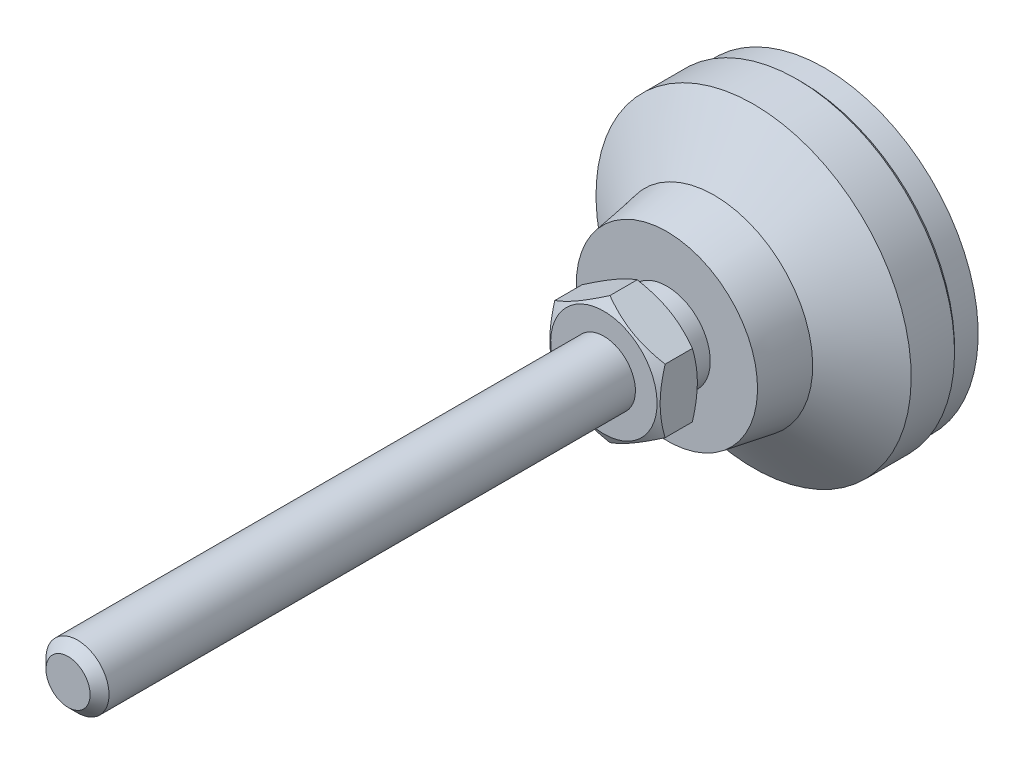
ISO-10303-21;
HEADER;
FILE_DESCRIPTION(('STEP AP214'),'2;1');
FILE_NAME('part.step','',(''),(''),'','','');
FILE_SCHEMA(('AUTOMOTIVE_DESIGN { 1 0 10303 214 1 1 1 1 }'));
ENDSEC;
DATA;
#1=APPLICATION_CONTEXT('core data for automotive mechanical design processes');
#2=APPLICATION_PROTOCOL_DEFINITION('international standard','automotive_design',2000,#1);
#3=PRODUCT_CONTEXT('',#1,'mechanical');
#4=PRODUCT('Part','Part','',(#3));
#5=PRODUCT_RELATED_PRODUCT_CATEGORY('part','',(#4));
#6=PRODUCT_DEFINITION_FORMATION('','',#4);
#7=PRODUCT_DEFINITION_CONTEXT('part definition',#1,'design');
#8=PRODUCT_DEFINITION('design','',#6,#7);
#9=PRODUCT_DEFINITION_SHAPE('','',#8);
#10=(LENGTH_UNIT() NAMED_UNIT(*) SI_UNIT(.MILLI.,.METRE.));
#11=(NAMED_UNIT(*) PLANE_ANGLE_UNIT() SI_UNIT($,.RADIAN.));
#12=(NAMED_UNIT(*) SI_UNIT($,.STERADIAN.) SOLID_ANGLE_UNIT());
#13=UNCERTAINTY_MEASURE_WITH_UNIT(LENGTH_MEASURE(1.E-05),#10,'distance_accuracy_value','');
#14=(GEOMETRIC_REPRESENTATION_CONTEXT(3) GLOBAL_UNCERTAINTY_ASSIGNED_CONTEXT((#13)) GLOBAL_UNIT_ASSIGNED_CONTEXT((#10,
#11,#12)) REPRESENTATION_CONTEXT('',''));
#15=CARTESIAN_POINT('',(0.,0.,0.));
#16=DIRECTION('',(0.,0.,1.));
#17=DIRECTION('',(1.,0.,0.));
#18=AXIS2_PLACEMENT_3D('',#15,#16,#17);
#19=CARTESIAN_POINT('',(0.,0.,1.99999999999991));
#20=DIRECTION('',(0.,0.,-1.));
#21=DIRECTION('',(0.,1.,0.));
#22=AXIS2_PLACEMENT_3D('',#19,#20,#21);
#23=CYLINDRICAL_SURFACE('',#22,20.);
#24=CARTESIAN_POINT('',(0.,0.,3.5));
#25=DIRECTION('',(0.,0.,-1.));
#26=DIRECTION('',(0.,1.,0.));
#27=AXIS2_PLACEMENT_3D('',#24,#25,#26);
#28=CIRCLE('',#27,20.);
#29=CARTESIAN_POINT('',(0.,20.,3.5));
#30=VERTEX_POINT('',#29);
#31=EDGE_CURVE('E28',#30,#30,#28,.F.);
#32=ORIENTED_EDGE('',*,*,#31,.T.);
#33=EDGE_LOOP('',(#32));
#34=FACE_BOUND('',#33,.T.);
#35=CARTESIAN_POINT('',(0.,0.,9.));
#36=DIRECTION('',(0.,0.,-1.));
#37=DIRECTION('',(0.,1.,0.));
#38=AXIS2_PLACEMENT_3D('',#35,#36,#37);
#39=CIRCLE('',#38,20.);
#40=CARTESIAN_POINT('',(0.,20.,9.));
#41=VERTEX_POINT('',#40);
#42=EDGE_CURVE('E112',#41,#41,#39,.T.);
#43=ORIENTED_EDGE('',*,*,#42,.T.);
#44=EDGE_LOOP('',(#43));
#45=FACE_BOUND('',#44,.T.);
#46=ADVANCED_FACE('F14',(#34,#45),#23,.T.);
#47=CARTESIAN_POINT('',(0.,0.,14.));
#48=DIRECTION('',(0.,0.,-1.));
#49=DIRECTION('',(0.,1.,0.));
#50=AXIS2_PLACEMENT_3D('',#47,#48,#49);
#51=CONICAL_SURFACE('',#50,12.5,0.98279372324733);
#52=ORIENTED_EDGE('',*,*,#42,.F.);
#53=EDGE_LOOP('',(#52));
#54=FACE_BOUND('',#53,.T.);
#55=CARTESIAN_POINT('',(0.,0.,14.));
#56=DIRECTION('',(0.,0.,-1.));
#57=DIRECTION('',(0.,1.,0.));
#58=AXIS2_PLACEMENT_3D('',#55,#56,#57);
#59=CIRCLE('',#58,12.5);
#60=CARTESIAN_POINT('',(0.,12.5,14.));
#61=VERTEX_POINT('',#60);
#62=EDGE_CURVE('E109',#61,#61,#59,.T.);
#63=ORIENTED_EDGE('',*,*,#62,.T.);
#64=EDGE_LOOP('',(#63));
#65=FACE_BOUND('',#64,.T.);
#66=ADVANCED_FACE('F142',(#54,#65),#51,.T.);
#67=CARTESIAN_POINT('',(0.,0.,20.));
#68=DIRECTION('',(0.,0.,-1.));
#69=DIRECTION('',(0.,1.,0.));
#70=AXIS2_PLACEMENT_3D('',#67,#68,#69);
#71=CONICAL_SURFACE('',#70,11.5,0.165148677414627);
#72=ORIENTED_EDGE('',*,*,#62,.F.);
#73=EDGE_LOOP('',(#72));
#74=FACE_BOUND('',#73,.T.);
#75=CARTESIAN_POINT('',(0.,0.,20.));
#76=DIRECTION('',(0.,0.,-1.));
#77=DIRECTION('',(0.,1.,0.));
#78=AXIS2_PLACEMENT_3D('',#75,#76,#77);
#79=CIRCLE('',#78,11.5);
#80=CARTESIAN_POINT('',(0.,11.5,20.));
#81=VERTEX_POINT('',#80);
#82=EDGE_CURVE('E106',#81,#81,#79,.T.);
#83=ORIENTED_EDGE('',*,*,#82,.T.);
#84=EDGE_LOOP('',(#83));
#85=FACE_BOUND('',#84,.T.);
#86=ADVANCED_FACE('F147',(#74,#85),#71,.T.);
#87=CARTESIAN_POINT('',(-11.5,0.,20.));
#88=DIRECTION('',(0.,0.,-1.));
#89=DIRECTION('',(0.,1.,0.));
#90=AXIS2_PLACEMENT_3D('',#87,#88,#89);
#91=PLANE('',#90);
#92=ORIENTED_EDGE('',*,*,#82,.F.);
#93=EDGE_LOOP('',(#92));
#94=FACE_BOUND('',#93,.T.);
#95=CARTESIAN_POINT('',(0.,0.,20.));
#96=DIRECTION('',(0.,0.,-1.));
#97=DIRECTION('',(0.,1.,0.));
#98=AXIS2_PLACEMENT_3D('',#95,#96,#97);
#99=CIRCLE('',#98,5.49999999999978);
#100=CARTESIAN_POINT('',(0.,5.49999999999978,20.));
#101=VERTEX_POINT('',#100);
#102=EDGE_CURVE('E103',#101,#101,#99,.T.);
#103=ORIENTED_EDGE('',*,*,#102,.T.);
#104=EDGE_LOOP('',(#103));
#105=FACE_BOUND('',#104,.T.);
#106=ADVANCED_FACE('F153',(#94,#105),#91,.F.);
#107=CARTESIAN_POINT('',(0.,0.,1.99999999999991));
#108=DIRECTION('',(0.,0.,-1.));
#109=DIRECTION('',(0.,1.,0.));
#110=AXIS2_PLACEMENT_3D('',#107,#108,#109);
#111=CYLINDRICAL_SURFACE('',#110,5.49999999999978);
#112=ORIENTED_EDGE('',*,*,#102,.F.);
#113=EDGE_LOOP('',(#112));
#114=FACE_BOUND('',#113,.T.);
#115=CARTESIAN_POINT('',(0.,0.,23.));
#116=DIRECTION('',(0.,0.,-1.));
#117=DIRECTION('',(0.,1.,0.));
#118=AXIS2_PLACEMENT_3D('',#115,#116,#117);
#119=CIRCLE('',#118,5.49999999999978);
#120=CARTESIAN_POINT('',(0.,5.49999999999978,23.));
#121=VERTEX_POINT('',#120);
#122=EDGE_CURVE('E100',#121,#121,#119,.T.);
#123=ORIENTED_EDGE('',*,*,#122,.T.);
#124=EDGE_LOOP('',(#123));
#125=FACE_BOUND('',#124,.T.);
#126=ADVANCED_FACE('F157',(#114,#125),#111,.T.);
#127=CARTESIAN_POINT('',(-5.49999999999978,0.,23.));
#128=DIRECTION('',(0.,0.,1.));
#129=DIRECTION('',(0.,-1.,0.));
#130=AXIS2_PLACEMENT_3D('',#127,#128,#129);
#131=PLANE('',#130);
#132=CARTESIAN_POINT('',(0.,0.,23.));
#133=DIRECTION('',(0.,0.,1.));
#134=DIRECTION('',(0.,-1.,0.));
#135=AXIS2_PLACEMENT_3D('',#132,#133,#134);
#136=CIRCLE('',#135,6.75);
#137=CARTESIAN_POINT('',(0.,-6.75,23.));
#138=VERTEX_POINT('',#137);
#139=EDGE_CURVE('E287',#138,#138,#136,.T.);
#140=ORIENTED_EDGE('',*,*,#139,.F.);
#141=EDGE_LOOP('',(#140));
#142=FACE_BOUND('',#141,.T.);
#143=ORIENTED_EDGE('',*,*,#122,.F.);
#144=EDGE_LOOP('',(#143));
#145=FACE_BOUND('',#144,.T.);
#146=ADVANCED_FACE('F125',(#142,#145),#131,.F.);
#147=CARTESIAN_POINT('',(0.,0.,3.));
#148=DIRECTION('',(0.,0.,1.));
#149=DIRECTION('',(0.,-1.,0.));
#150=AXIS2_PLACEMENT_3D('',#147,#148,#149);
#151=CONICAL_SURFACE('',#150,19.5,0.785398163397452);
#152=ORIENTED_EDGE('',*,*,#31,.F.);
#153=EDGE_LOOP('',(#152));
#154=FACE_BOUND('',#153,.T.);
#155=CARTESIAN_POINT('',(0.,0.,3.));
#156=DIRECTION('',(0.,0.,-1.));
#157=DIRECTION('',(0.,1.,0.));
#158=AXIS2_PLACEMENT_3D('',#155,#156,#157);
#159=CIRCLE('',#158,19.5);
#160=CARTESIAN_POINT('',(0.,19.5,3.));
#161=VERTEX_POINT('',#160);
#162=EDGE_CURVE('E115',#161,#161,#159,.T.);
#163=ORIENTED_EDGE('',*,*,#162,.F.);
#164=EDGE_LOOP('',(#163));
#165=FACE_BOUND('',#164,.T.);
#166=ADVANCED_FACE('F16',(#154,#165),#151,.T.);
#167=CARTESIAN_POINT('',(0.,0.,0.));
#168=DIRECTION('',(0.,0.,1.));
#169=DIRECTION('',(0.,-1.,0.));
#170=AXIS2_PLACEMENT_3D('',#167,#168,#169);
#171=CYLINDRICAL_SURFACE('',#170,19.5);
#172=CARTESIAN_POINT('',(0.,0.,0.));
#173=DIRECTION('',(0.,0.,-1.));
#174=DIRECTION('',(0.,1.,0.));
#175=AXIS2_PLACEMENT_3D('',#172,#173,#174);
#176=CIRCLE('',#175,19.5);
#177=CARTESIAN_POINT('',(0.,19.5,0.));
#178=VERTEX_POINT('',#177);
#179=EDGE_CURVE('E262',#178,#178,#176,.T.);
#180=ORIENTED_EDGE('',*,*,#179,.F.);
#181=EDGE_LOOP('',(#180));
#182=FACE_BOUND('',#181,.T.);
#183=ORIENTED_EDGE('',*,*,#162,.T.);
#184=EDGE_LOOP('',(#183));
#185=FACE_BOUND('',#184,.T.);
#186=ADVANCED_FACE('F124',(#182,#185),#171,.T.);
#187=CARTESIAN_POINT('',(0.,0.,0.));
#188=DIRECTION('',(0.,0.,-1.));
#189=DIRECTION('',(0.,1.,0.));
#190=AXIS2_PLACEMENT_3D('',#187,#188,#189);
#191=PLANE('',#190);
#192=ORIENTED_EDGE('',*,*,#179,.T.);
#193=EDGE_LOOP('',(#192));
#194=FACE_BOUND('',#193,.T.);
#195=ADVANCED_FACE('F129',(#194),#191,.T.);
#196=CARTESIAN_POINT('',(0.,0.,23.));
#197=DIRECTION('',(0.,0.,1.));
#198=DIRECTION('',(0.,-1.,0.));
#199=AXIS2_PLACEMENT_3D('',#196,#197,#198);
#200=CONICAL_SURFACE('',#199,6.75,1.0471975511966);
#201=CARTESIAN_POINT('',(0.000200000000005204,-8.08301923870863,23.7696190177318));
#202=CARTESIAN_POINT('',(-0.153667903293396,-7.99418356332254,23.7183374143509));
#203=CARTESIAN_POINT('',(-0.308109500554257,-7.90501666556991,23.669383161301));
#204=CARTESIAN_POINT('',(-0.618246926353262,-7.72595873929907,23.5767703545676));
#205=CARTESIAN_POINT('',(-0.773943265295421,-7.63606741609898,23.5331140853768));
#206=CARTESIAN_POINT('',(-1.24352516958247,-7.36495417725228,23.4109491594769));
#207=CARTESIAN_POINT('',(-1.55926433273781,-7.18266208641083,23.3414631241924));
#208=CARTESIAN_POINT('',(-2.03176224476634,-6.90986528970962,23.2599825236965));
#209=CARTESIAN_POINT('',(-2.1871092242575,-6.82017566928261,23.2367710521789));
#210=CARTESIAN_POINT('',(-2.49850511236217,-6.64039116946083,23.1978487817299));
#211=CARTESIAN_POINT('',(-2.65455395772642,-6.55029632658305,23.1821373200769));
#212=CARTESIAN_POINT('',(-2.96692267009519,-6.36995016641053,23.1586154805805));
#213=CARTESIAN_POINT('',(-3.12324202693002,-6.27969914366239,23.1507961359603));
#214=CARTESIAN_POINT('',(-3.43601650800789,-6.09911871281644,23.1432178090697));
#215=CARTESIAN_POINT('',(-3.59247162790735,-6.00878930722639,23.1434585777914));
#216=CARTESIAN_POINT('',(-4.02110687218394,-5.76131663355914,23.1551972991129));
#217=CARTESIAN_POINT('',(-4.2931466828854,-5.60425437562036,23.1749033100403));
#218=CARTESIAN_POINT('',(-4.83541944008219,-5.29117305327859,23.2373910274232));
#219=CARTESIAN_POINT('',(-5.10565047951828,-5.13515508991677,23.2801940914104));
#220=CARTESIAN_POINT('',(-5.64901454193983,-4.82144370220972,23.3871892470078));
#221=CARTESIAN_POINT('',(-5.92207900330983,-4.66378986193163,23.4518346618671));
#222=CARTESIAN_POINT('',(-6.46413578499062,-4.35083323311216,23.5985536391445));
#223=CARTESIAN_POINT('',(-6.73313504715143,-4.19552643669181,23.680592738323));
#224=CARTESIAN_POINT('',(-7.0002,-4.04133641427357,23.7696190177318));
#225=B_SPLINE_CURVE_WITH_KNOTS('',3,(#201,#202,#203,#204,#205,#206,#207,#208,#209,#210,#211,
#212,#213,#214,#215,#216,#217,#218,#219,#220,#221,#222,#223,#224),.UNSPECIFIED.,.F.,.F.,(4,2,2,
2,2,2,2,2,2,2,2,4),(0.,0.554727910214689,1.10969417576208,2.2219327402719,2.76443041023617,
3.30688013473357,3.8487128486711,4.39052882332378,5.33376515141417,6.27787517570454,
7.24292418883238,8.20607866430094),.UNSPECIFIED.);
#226=CARTESIAN_POINT('',(0.,-8.08290376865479,23.7695523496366));
#227=VERTEX_POINT('',#226);
#228=CARTESIAN_POINT('',(-7.,-4.04145188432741,23.7695523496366));
#229=VERTEX_POINT('',#228);
#230=EDGE_CURVE('E73',#227,#229,#225,.T.);
#231=ORIENTED_EDGE('',*,*,#230,.T.);
#232=CARTESIAN_POINT('',(-7.,10.8225326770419,26.5443732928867));
#233=CARTESIAN_POINT('',(-7.,10.5170732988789,26.3963323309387));
#234=CARTESIAN_POINT('',(-7.,10.2109091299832,26.2497205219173));
#235=CARTESIAN_POINT('',(-7.,9.59679626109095,25.9601596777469));
#236=CARTESIAN_POINT('',(-7.,9.28884728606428,25.8172112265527));
#237=CARTESIAN_POINT('',(-7.,8.66918718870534,25.5350552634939));
#238=CARTESIAN_POINT('',(-7.,8.35746469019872,25.3958726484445));
#239=CARTESIAN_POINT('',(-7.,7.73152870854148,25.1232479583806));
#240=CARTESIAN_POINT('',(-7.,7.41731534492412,24.9898056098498));
#241=CARTESIAN_POINT('',(-7.,6.77588684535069,24.7260618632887));
#242=CARTESIAN_POINT('',(-7.,6.44857517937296,24.5959939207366));
#243=CARTESIAN_POINT('',(-7.,5.7901110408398,24.3457829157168));
#244=CARTESIAN_POINT('',(-7.,5.4589581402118,24.225640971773));
#245=CARTESIAN_POINT('',(-7.,4.79291133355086,23.9984607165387));
#246=CARTESIAN_POINT('',(-7.,4.45802667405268,23.891395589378));
#247=CARTESIAN_POINT('',(-7.,3.78346599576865,23.6938249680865));
#248=CARTESIAN_POINT('',(-7.,3.44379153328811,23.6033142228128));
#249=CARTESIAN_POINT('',(-7.,2.76127946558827,23.4437032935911));
#250=CARTESIAN_POINT('',(-7.,2.41846944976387,23.3744883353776));
#251=CARTESIAN_POINT('',(-7.,1.90115950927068,23.2896511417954));
#252=CARTESIAN_POINT('',(-7.,1.72819408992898,23.2645351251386));
#253=CARTESIAN_POINT('',(-7.,1.38141489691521,23.2211248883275));
#254=CARTESIAN_POINT('',(-7.,1.2076012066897,23.2028300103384));
#255=CARTESIAN_POINT('',(-7.,0.861614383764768,23.1736542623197));
#256=CARTESIAN_POINT('',(-7.,0.6894491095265,23.1626805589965));
#257=CARTESIAN_POINT('',(-7.,0.344808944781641,23.1480211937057));
#258=CARTESIAN_POINT('',(-7.,0.172334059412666,23.1443354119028));
#259=CARTESIAN_POINT('',(-7.,-0.172617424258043,23.1443397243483));
#260=CARTESIAN_POINT('',(-7.,-0.345094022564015,23.1480298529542));
#261=CARTESIAN_POINT('',(-7.,-0.689739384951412,23.1626963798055));
#262=CARTESIAN_POINT('',(-7.,-0.861908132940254,23.1736731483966));
#263=CARTESIAN_POINT('',(-7.,-1.27669593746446,23.2086648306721));
#264=CARTESIAN_POINT('',(-7.,-1.51902473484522,23.2361932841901));
#265=CARTESIAN_POINT('',(-7.,-2.00185042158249,23.3041758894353));
#266=CARTESIAN_POINT('',(-7.,-2.24234705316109,23.3446318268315));
#267=CARTESIAN_POINT('',(-7.,-2.96083241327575,23.4832428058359));
#268=CARTESIAN_POINT('',(-7.,-3.43554171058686,23.5986147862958));
#269=CARTESIAN_POINT('',(-7.,-4.14531660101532,23.7982617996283));
#270=CARTESIAN_POINT('',(-7.,-4.38407423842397,23.8701623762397));
#271=CARTESIAN_POINT('',(-7.,-4.85926979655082,24.0213271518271));
#272=CARTESIAN_POINT('',(-7.,-5.09570770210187,24.1005913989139));
#273=CARTESIAN_POINT('',(-7.,-5.56634020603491,24.2652204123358));
#274=CARTESIAN_POINT('',(-7.,-5.80053553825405,24.3505830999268));
#275=CARTESIAN_POINT('',(-7.,-6.26699283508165,24.5264150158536));
#276=CARTESIAN_POINT('',(-7.,-6.49925482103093,24.6168841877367));
#277=CARTESIAN_POINT('',(-7.,-7.04205780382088,24.8340904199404));
#278=CARTESIAN_POINT('',(-7.,-7.35190632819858,24.9625546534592));
#279=CARTESIAN_POINT('',(-7.,-7.9690151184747,25.2255736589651));
#280=CARTESIAN_POINT('',(-7.,-8.27627523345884,25.3601287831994));
#281=CARTESIAN_POINT('',(-7.,-8.8886763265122,25.6341212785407));
#282=CARTESIAN_POINT('',(-7.,-9.19381688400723,25.7735595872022));
#283=CARTESIAN_POINT('',(-7.,-9.80228057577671,26.0563535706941));
#284=CARTESIAN_POINT('',(-7.,-10.105603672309,26.1997093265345));
#285=CARTESIAN_POINT('',(-7.,-10.7110331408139,26.4897582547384));
#286=CARTESIAN_POINT('',(-7.,-11.0131379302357,26.6364547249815));
#287=CARTESIAN_POINT('',(-7.,-11.6160559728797,26.9324805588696));
#288=CARTESIAN_POINT('',(-7.,-11.9168692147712,27.081809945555));
#289=CARTESIAN_POINT('',(-7.,-12.8176001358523,27.5330165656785));
#290=CARTESIAN_POINT('',(-7.,-13.4158866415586,27.8381497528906));
#291=CARTESIAN_POINT('',(-7.,-14.5601150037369,28.4291471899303));
#292=CARTESIAN_POINT('',(-7.,-15.1063079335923,28.7145274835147));
#293=CARTESIAN_POINT('',(-7.,-16.1966602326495,29.2891883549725));
#294=CARTESIAN_POINT('',(-7.,-16.7408195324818,29.5784690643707));
#295=CARTESIAN_POINT('',(-7.,-17.826233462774,30.1593029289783));
#296=CARTESIAN_POINT('',(-7.,-18.3674919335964,30.4508489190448));
#297=CARTESIAN_POINT('',(-7.,-19.4487056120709,31.0362797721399));
#298=CARTESIAN_POINT('',(-7.,-19.9886608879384,31.3301645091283));
#299=CARTESIAN_POINT('',(-7.,-20.5281350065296,31.6249239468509));
#300=B_SPLINE_CURVE_WITH_KNOTS('',3,(#232,#233,#234,#235,#236,#237,#238,#239,#240,#241,#242,
#243,#244,#245,#246,#247,#248,#249,#250,#251,#252,#253,#254,#255,#256,#257,#258,#259,#260,#261,
#262,#263,#264,#265,#266,#267,#268,#269,#270,#271,#272,#273,#274,#275,#276,#277,#278,#279,#280,
#281,#282,#283,#284,#285,#286,#287,#288,#289,#290,#291,#292,#293,#294,#295,#296,#297,#298,#299),
.UNSPECIFIED.,.F.,.F.,(4,2,2,2,2,2,2,2,2,2,2,2,2,2,2,2,2,2,2,2,2,2,2,2,2,2,2,2,2,2,2,2,2,4),(0.,
1.01834163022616,2.03684459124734,3.06094883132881,4.08500421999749,5.14150384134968,
6.19812235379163,7.25253638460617,8.30661536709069,9.35490960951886,9.8791345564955,
10.4033089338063,10.9207035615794,11.4380896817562,11.9554782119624,12.47289304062,
13.2041413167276,13.9354906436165,15.3990140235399,16.1469998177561,16.8949904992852,
17.6427274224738,18.3904560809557,19.3966404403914,20.4028830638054,21.4093199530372,
22.4157776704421,23.4232761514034,24.4307834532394,26.4455394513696,28.2942837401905,
30.1430905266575,31.9874374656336,33.8316856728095),.UNSPECIFIED.);
#301=CARTESIAN_POINT('',(-7.,4.04145188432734,23.7695523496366));
#302=VERTEX_POINT('',#301);
#303=EDGE_CURVE('E81',#229,#302,#300,.F.);
#304=ORIENTED_EDGE('',*,*,#303,.T.);
#305=CARTESIAN_POINT('',(-7.0002,4.0413364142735,23.7696190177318));
#306=CARTESIAN_POINT('',(-6.8463320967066,4.13017208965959,23.7183374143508));
#307=CARTESIAN_POINT('',(-6.69189049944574,4.21933898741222,23.669383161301));
#308=CARTESIAN_POINT('',(-6.38175307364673,4.39839691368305,23.5767703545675));
#309=CARTESIAN_POINT('',(-6.22605673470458,4.48828823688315,23.5331140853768));
#310=CARTESIAN_POINT('',(-5.75647483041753,4.75940147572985,23.4109491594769));
#311=CARTESIAN_POINT('',(-5.4407356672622,4.94169356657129,23.3414631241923));
#312=CARTESIAN_POINT('',(-4.96823775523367,5.2144903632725,23.2599825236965));
#313=CARTESIAN_POINT('',(-4.81289077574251,5.30417998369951,23.2367710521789));
#314=CARTESIAN_POINT('',(-4.50149488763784,5.48396448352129,23.1978487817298));
#315=CARTESIAN_POINT('',(-4.34544604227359,5.57405932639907,23.1821373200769));
#316=CARTESIAN_POINT('',(-4.03307732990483,5.75440548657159,23.1586154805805));
#317=CARTESIAN_POINT('',(-3.87675797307,5.84465650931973,23.1507961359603));
#318=CARTESIAN_POINT('',(-3.56398349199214,6.02523694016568,23.1432178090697));
#319=CARTESIAN_POINT('',(-3.40752837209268,6.11556634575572,23.1434585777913));
#320=CARTESIAN_POINT('',(-2.97889312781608,6.36303901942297,23.1551972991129));
#321=CARTESIAN_POINT('',(-2.70685331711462,6.52010127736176,23.1749033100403));
#322=CARTESIAN_POINT('',(-2.16458055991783,6.83318259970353,23.2373910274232));
#323=CARTESIAN_POINT('',(-1.89434952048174,6.98920056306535,23.2801940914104));
#324=CARTESIAN_POINT('',(-1.35098545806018,7.3029119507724,23.3871892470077));
#325=CARTESIAN_POINT('',(-1.07792099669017,7.4605657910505,23.4518346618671));
#326=CARTESIAN_POINT('',(-0.535864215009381,7.77352241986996,23.5985536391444));
#327=CARTESIAN_POINT('',(-0.266864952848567,7.92882921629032,23.6805927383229));
#328=CARTESIAN_POINT('',(0.000200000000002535,8.08301923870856,23.7696190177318));
#329=B_SPLINE_CURVE_WITH_KNOTS('',3,(#305,#306,#307,#308,#309,#310,#311,#312,#313,#314,#315,
#316,#317,#318,#319,#320,#321,#322,#323,#324,#325,#326,#327,#328),.UNSPECIFIED.,.F.,.F.,(4,2,2,
2,2,2,2,2,2,2,2,4),(0.,0.554727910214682,1.10969417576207,2.22193274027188,2.76443041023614,
3.30688013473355,3.84871284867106,4.39052882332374,5.33376515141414,6.27787517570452,
7.24292418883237,8.20607866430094),.UNSPECIFIED.);
#330=CARTESIAN_POINT('',(0.,8.08290376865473,23.7695523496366));
#331=VERTEX_POINT('',#330);
#332=EDGE_CURVE('E225',#302,#331,#329,.T.);
#333=ORIENTED_EDGE('',*,*,#332,.T.);
#334=CARTESIAN_POINT('',(-0.000199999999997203,8.08301923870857,23.7696190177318));
#335=CARTESIAN_POINT('',(0.153667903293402,7.99418356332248,23.7183374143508));
#336=CARTESIAN_POINT('',(0.308109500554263,7.90501666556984,23.669383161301));
#337=CARTESIAN_POINT('',(0.618246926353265,7.72595873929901,23.5767703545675));
#338=CARTESIAN_POINT('',(0.773943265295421,7.63606741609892,23.5331140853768));
#339=CARTESIAN_POINT('',(1.24352516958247,7.36495417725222,23.4109491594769));
#340=CARTESIAN_POINT('',(1.5592643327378,7.18266208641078,23.3414631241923));
#341=CARTESIAN_POINT('',(2.03176224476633,6.90986528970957,23.2599825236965));
#342=CARTESIAN_POINT('',(2.18710922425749,6.82017566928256,23.2367710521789));
#343=CARTESIAN_POINT('',(2.49850511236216,6.64039116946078,23.1978487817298));
#344=CARTESIAN_POINT('',(2.65455395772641,6.550296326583,23.1821373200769));
#345=CARTESIAN_POINT('',(2.96692267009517,6.36995016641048,23.1586154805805));
#346=CARTESIAN_POINT('',(3.12324202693,6.27969914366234,23.1507961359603));
#347=CARTESIAN_POINT('',(3.43601650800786,6.09911871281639,23.1432178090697));
#348=CARTESIAN_POINT('',(3.59247162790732,6.00878930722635,23.1434585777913));
#349=CARTESIAN_POINT('',(4.02110687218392,5.7613166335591,23.1551972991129));
#350=CARTESIAN_POINT('',(4.29314668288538,5.60425437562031,23.1749033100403));
#351=CARTESIAN_POINT('',(4.83541944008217,5.29117305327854,23.2373910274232));
#352=CARTESIAN_POINT('',(5.10565047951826,5.13515508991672,23.2801940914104));
#353=CARTESIAN_POINT('',(5.64901454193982,4.82144370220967,23.3871892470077));
#354=CARTESIAN_POINT('',(5.92207900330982,4.66378986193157,23.4518346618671));
#355=CARTESIAN_POINT('',(6.46413578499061,4.35083323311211,23.5985536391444));
#356=CARTESIAN_POINT('',(6.73313504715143,4.19552643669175,23.6805927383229));
#357=CARTESIAN_POINT('',(7.0002,4.04133641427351,23.7696190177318));
#358=B_SPLINE_CURVE_WITH_KNOTS('',3,(#334,#335,#336,#337,#338,#339,#340,#341,#342,#343,#344,
#345,#346,#347,#348,#349,#350,#351,#352,#353,#354,#355,#356,#357),.UNSPECIFIED.,.F.,.F.,(4,2,2,
2,2,2,2,2,2,2,2,4),(0.,0.554727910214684,1.10969417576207,2.22193274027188,2.76443041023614,
3.30688013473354,3.84871284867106,4.39052882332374,5.33376515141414,6.27787517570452,
7.24292418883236,8.20607866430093),.UNSPECIFIED.);
#359=CARTESIAN_POINT('',(7.,4.04145188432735,23.7695523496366));
#360=VERTEX_POINT('',#359);
#361=EDGE_CURVE('E219',#331,#360,#358,.T.);
#362=ORIENTED_EDGE('',*,*,#361,.T.);
#363=CARTESIAN_POINT('',(7.,10.8225326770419,26.5443732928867));
#364=CARTESIAN_POINT('',(7.,10.5170732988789,26.3963323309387));
#365=CARTESIAN_POINT('',(7.,10.2109091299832,26.2497205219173));
#366=CARTESIAN_POINT('',(7.,9.59679626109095,25.9601596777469));
#367=CARTESIAN_POINT('',(7.,9.28884728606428,25.8172112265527));
#368=CARTESIAN_POINT('',(7.,8.66918718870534,25.5350552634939));
#369=CARTESIAN_POINT('',(7.,8.35746469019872,25.3958726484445));
#370=CARTESIAN_POINT('',(7.,7.73152870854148,25.1232479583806));
#371=CARTESIAN_POINT('',(7.,7.41731534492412,24.9898056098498));
#372=CARTESIAN_POINT('',(7.,6.77588684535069,24.7260618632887));
#373=CARTESIAN_POINT('',(7.,6.44857517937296,24.5959939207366));
#374=CARTESIAN_POINT('',(7.,5.7901110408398,24.3457829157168));
#375=CARTESIAN_POINT('',(7.,5.4589581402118,24.225640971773));
#376=CARTESIAN_POINT('',(7.,4.79291133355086,23.9984607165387));
#377=CARTESIAN_POINT('',(7.,4.45802667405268,23.891395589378));
#378=CARTESIAN_POINT('',(7.,3.78346599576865,23.6938249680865));
#379=CARTESIAN_POINT('',(7.,3.44379153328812,23.6033142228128));
#380=CARTESIAN_POINT('',(7.,2.76127946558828,23.443703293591));
#381=CARTESIAN_POINT('',(7.,2.41846944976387,23.3744883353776));
#382=CARTESIAN_POINT('',(7.,1.90115950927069,23.2896511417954));
#383=CARTESIAN_POINT('',(7.,1.72819408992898,23.2645351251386));
#384=CARTESIAN_POINT('',(7.,1.38141489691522,23.2211248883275));
#385=CARTESIAN_POINT('',(7.,1.20760120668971,23.2028300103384));
#386=CARTESIAN_POINT('',(7.,0.861614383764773,23.1736542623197));
#387=CARTESIAN_POINT('',(7.,0.689449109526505,23.1626805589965));
#388=CARTESIAN_POINT('',(7.,0.344808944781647,23.1480211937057));
#389=CARTESIAN_POINT('',(7.,0.172334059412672,23.1443354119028));
#390=CARTESIAN_POINT('',(7.,-0.172617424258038,23.1443397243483));
#391=CARTESIAN_POINT('',(7.,-0.34509402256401,23.1480298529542));
#392=CARTESIAN_POINT('',(7.,-0.689739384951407,23.1626963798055));
#393=CARTESIAN_POINT('',(7.,-0.861908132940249,23.1736731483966));
#394=CARTESIAN_POINT('',(7.,-1.27669593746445,23.2086648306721));
#395=CARTESIAN_POINT('',(7.,-1.51902473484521,23.2361932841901));
#396=CARTESIAN_POINT('',(7.,-2.00185042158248,23.3041758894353));
#397=CARTESIAN_POINT('',(7.,-2.24234705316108,23.3446318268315));
#398=CARTESIAN_POINT('',(7.,-2.96083241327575,23.4832428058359));
#399=CARTESIAN_POINT('',(7.,-3.43554171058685,23.5986147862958));
#400=CARTESIAN_POINT('',(7.,-4.14531660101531,23.7982617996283));
#401=CARTESIAN_POINT('',(7.,-4.38407423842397,23.8701623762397));
#402=CARTESIAN_POINT('',(7.,-4.85926979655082,24.0213271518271));
#403=CARTESIAN_POINT('',(7.,-5.09570770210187,24.1005913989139));
#404=CARTESIAN_POINT('',(7.,-5.5663402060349,24.2652204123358));
#405=CARTESIAN_POINT('',(7.,-5.80053553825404,24.3505830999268));
#406=CARTESIAN_POINT('',(7.,-6.26699283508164,24.5264150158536));
#407=CARTESIAN_POINT('',(7.,-6.49925482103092,24.6168841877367));
#408=CARTESIAN_POINT('',(7.,-7.04205780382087,24.8340904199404));
#409=CARTESIAN_POINT('',(7.,-7.35190632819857,24.9625546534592));
#410=CARTESIAN_POINT('',(7.,-7.9690151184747,25.2255736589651));
#411=CARTESIAN_POINT('',(7.,-8.27627523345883,25.3601287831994));
#412=CARTESIAN_POINT('',(7.,-8.88867632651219,25.6341212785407));
#413=CARTESIAN_POINT('',(7.,-9.19381688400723,25.7735595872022));
#414=CARTESIAN_POINT('',(7.,-9.80228057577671,26.0563535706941));
#415=CARTESIAN_POINT('',(7.,-10.105603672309,26.1997093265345));
#416=CARTESIAN_POINT('',(7.,-10.7110331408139,26.4897582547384));
#417=CARTESIAN_POINT('',(7.,-11.0131379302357,26.6364547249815));
#418=CARTESIAN_POINT('',(7.,-11.6160559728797,26.9324805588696));
#419=CARTESIAN_POINT('',(7.,-11.9168692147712,27.081809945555));
#420=CARTESIAN_POINT('',(7.,-12.8176001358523,27.5330165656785));
#421=CARTESIAN_POINT('',(7.,-13.4158866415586,27.8381497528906));
#422=CARTESIAN_POINT('',(7.,-14.5601150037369,28.4291471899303));
#423=CARTESIAN_POINT('',(7.,-15.1063079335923,28.7145274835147));
#424=CARTESIAN_POINT('',(7.,-16.1966602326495,29.2891883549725));
#425=CARTESIAN_POINT('',(7.,-16.7408195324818,29.5784690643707));
#426=CARTESIAN_POINT('',(7.,-17.826233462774,30.1593029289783));
#427=CARTESIAN_POINT('',(7.,-18.3674919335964,30.4508489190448));
#428=CARTESIAN_POINT('',(7.,-19.4487056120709,31.0362797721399));
#429=CARTESIAN_POINT('',(7.,-19.9886608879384,31.3301645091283));
#430=CARTESIAN_POINT('',(7.,-20.5281350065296,31.6249239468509));
#431=B_SPLINE_CURVE_WITH_KNOTS('',3,(#363,#364,#365,#366,#367,#368,#369,#370,#371,#372,#373,
#374,#375,#376,#377,#378,#379,#380,#381,#382,#383,#384,#385,#386,#387,#388,#389,#390,#391,#392,
#393,#394,#395,#396,#397,#398,#399,#400,#401,#402,#403,#404,#405,#406,#407,#408,#409,#410,#411,
#412,#413,#414,#415,#416,#417,#418,#419,#420,#421,#422,#423,#424,#425,#426,#427,#428,#429,#430),
.UNSPECIFIED.,.F.,.F.,(4,2,2,2,2,2,2,2,2,2,2,2,2,2,2,2,2,2,2,2,2,2,2,2,2,2,2,2,2,2,2,2,2,4),(0.,
1.01834163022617,2.03684459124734,3.06094883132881,4.08500421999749,5.14150384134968,
6.19812235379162,7.25253638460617,8.30661536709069,9.35490960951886,9.87913455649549,
10.4033089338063,10.9207035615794,11.4380896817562,11.9554782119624,12.4728930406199,
13.2041413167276,13.9354906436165,15.3990140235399,16.1469998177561,16.8949904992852,
17.6427274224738,18.3904560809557,19.3966404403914,20.4028830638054,21.4093199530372,
22.415777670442,23.4232761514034,24.4307834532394,26.4455394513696,28.2942837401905,
30.1430905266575,31.9874374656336,33.8316856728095),.UNSPECIFIED.);
#432=CARTESIAN_POINT('',(7.,-4.04145188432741,23.7695523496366));
#433=VERTEX_POINT('',#432);
#434=EDGE_CURVE('E34',#360,#433,#431,.T.);
#435=ORIENTED_EDGE('',*,*,#434,.T.);
#436=CARTESIAN_POINT('',(7.0002,-4.04133641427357,23.7696190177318));
#437=CARTESIAN_POINT('',(6.8463320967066,-4.13017208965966,23.7183374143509));
#438=CARTESIAN_POINT('',(6.69189049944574,-4.2193389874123,23.669383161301));
#439=CARTESIAN_POINT('',(6.38175307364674,-4.39839691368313,23.5767703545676));
#440=CARTESIAN_POINT('',(6.22605673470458,-4.48828823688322,23.5331140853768));
#441=CARTESIAN_POINT('',(5.75647483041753,-4.75940147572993,23.4109491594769));
#442=CARTESIAN_POINT('',(5.44073566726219,-4.94169356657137,23.3414631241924));
#443=CARTESIAN_POINT('',(4.96823775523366,-5.21449036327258,23.2599825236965));
#444=CARTESIAN_POINT('',(4.8128907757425,-5.30417998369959,23.2367710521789));
#445=CARTESIAN_POINT('',(4.50149488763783,-5.48396448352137,23.1978487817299));
#446=CARTESIAN_POINT('',(4.34544604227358,-5.57405932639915,23.1821373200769));
#447=CARTESIAN_POINT('',(4.03307732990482,-5.75440548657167,23.1586154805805));
#448=CARTESIAN_POINT('',(3.87675797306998,-5.84465650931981,23.1507961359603));
#449=CARTESIAN_POINT('',(3.56398349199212,-6.02523694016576,23.1432178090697));
#450=CARTESIAN_POINT('',(3.40752837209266,-6.11556634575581,23.1434585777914));
#451=CARTESIAN_POINT('',(2.97889312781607,-6.36303901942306,23.1551972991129));
#452=CARTESIAN_POINT('',(2.70685331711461,-6.52010127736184,23.1749033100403));
#453=CARTESIAN_POINT('',(2.16458055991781,-6.83318259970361,23.2373910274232));
#454=CARTESIAN_POINT('',(1.89434952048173,-6.98920056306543,23.2801940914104));
#455=CARTESIAN_POINT('',(1.35098545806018,-7.30291195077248,23.3871892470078));
#456=CARTESIAN_POINT('',(1.07792099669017,-7.46056579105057,23.4518346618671));
#457=CARTESIAN_POINT('',(0.535864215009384,-7.77352241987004,23.5985536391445));
#458=CARTESIAN_POINT('',(0.266864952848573,-7.92882921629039,23.680592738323));
#459=CARTESIAN_POINT('',(-0.000199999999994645,-8.08301923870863,23.7696190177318));
#460=B_SPLINE_CURVE_WITH_KNOTS('',3,(#436,#437,#438,#439,#440,#441,#442,#443,#444,#445,#446,
#447,#448,#449,#450,#451,#452,#453,#454,#455,#456,#457,#458,#459),.UNSPECIFIED.,.F.,.F.,(4,2,2,
2,2,2,2,2,2,2,2,4),(0.,0.554727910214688,1.10969417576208,2.22193274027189,2.76443041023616,
3.30688013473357,3.84871284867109,4.39052882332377,5.33376515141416,6.27787517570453,
7.24292418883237,8.20607866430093),.UNSPECIFIED.);
#461=EDGE_CURVE('E9',#433,#227,#460,.T.);
#462=ORIENTED_EDGE('',*,*,#461,.T.);
#463=EDGE_LOOP('',(#231,#304,#333,#362,#435,#462));
#464=FACE_BOUND('',#463,.T.);
#465=ORIENTED_EDGE('',*,*,#139,.T.);
#466=EDGE_LOOP('',(#465));
#467=FACE_BOUND('',#466,.T.);
#468=ADVANCED_FACE('F71',(#464,#467),#200,.T.);
#469=CARTESIAN_POINT('',(0.,0.,96.));
#470=DIRECTION('',(0.,0.,-1.));
#471=DIRECTION('',(0.,1.,0.));
#472=AXIS2_PLACEMENT_3D('',#469,#470,#471);
#473=PLANE('',#472);
#474=CARTESIAN_POINT('',(0.,0.,96.));
#475=DIRECTION('',(0.,0.,-1.));
#476=DIRECTION('',(0.,1.,0.));
#477=AXIS2_PLACEMENT_3D('',#474,#475,#476);
#478=CIRCLE('',#477,2.79999999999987);
#479=CARTESIAN_POINT('',(0.,2.79999999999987,96.));
#480=VERTEX_POINT('',#479);
#481=EDGE_CURVE('E88',#480,#480,#478,.T.);
#482=ORIENTED_EDGE('',*,*,#481,.F.);
#483=EDGE_LOOP('',(#482));
#484=FACE_BOUND('',#483,.T.);
#485=ADVANCED_FACE('F205',(#484),#473,.F.);
#486=CARTESIAN_POINT('',(0.,0.,96.));
#487=DIRECTION('',(0.,0.,-1.));
#488=DIRECTION('',(0.,1.,0.));
#489=AXIS2_PLACEMENT_3D('',#486,#487,#488);
#490=CONICAL_SURFACE('',#489,2.79999999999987,0.785398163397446);
#491=CARTESIAN_POINT('',(0.,0.,94.8));
#492=DIRECTION('',(0.,0.,-1.));
#493=DIRECTION('',(0.,1.,0.));
#494=AXIS2_PLACEMENT_3D('',#491,#492,#493);
#495=CIRCLE('',#494,3.99999999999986);
#496=CARTESIAN_POINT('',(0.,3.99999999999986,94.8));
#497=VERTEX_POINT('',#496);
#498=EDGE_CURVE('E93',#497,#497,#495,.T.);
#499=ORIENTED_EDGE('',*,*,#498,.F.);
#500=EDGE_LOOP('',(#499));
#501=FACE_BOUND('',#500,.T.);
#502=ORIENTED_EDGE('',*,*,#481,.T.);
#503=EDGE_LOOP('',(#502));
#504=FACE_BOUND('',#503,.T.);
#505=ADVANCED_FACE('F173',(#501,#504),#490,.T.);
#506=CARTESIAN_POINT('',(0.,0.,1.99999999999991));
#507=DIRECTION('',(0.,0.,-1.));
#508=DIRECTION('',(0.,1.,0.));
#509=AXIS2_PLACEMENT_3D('',#506,#507,#508);
#510=CYLINDRICAL_SURFACE('',#509,3.99999999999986);
#511=CARTESIAN_POINT('',(0.,0.,28.));
#512=DIRECTION('',(0.,0.,-1.));
#513=DIRECTION('',(0.,1.,0.));
#514=AXIS2_PLACEMENT_3D('',#511,#512,#513);
#515=CIRCLE('',#514,3.99999999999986);
#516=CARTESIAN_POINT('',(0.,3.99999999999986,28.));
#517=VERTEX_POINT('',#516);
#518=EDGE_CURVE('E97',#517,#517,#515,.T.);
#519=ORIENTED_EDGE('',*,*,#518,.F.);
#520=EDGE_LOOP('',(#519));
#521=FACE_BOUND('',#520,.T.);
#522=ORIENTED_EDGE('',*,*,#498,.T.);
#523=EDGE_LOOP('',(#522));
#524=FACE_BOUND('',#523,.T.);
#525=ADVANCED_FACE('F169',(#521,#524),#510,.T.);
#526=CARTESIAN_POINT('',(-3.99999999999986,0.,28.));
#527=DIRECTION('',(0.,0.,-1.));
#528=DIRECTION('',(0.,1.,0.));
#529=AXIS2_PLACEMENT_3D('',#526,#527,#528);
#530=PLANE('',#529);
#531=CARTESIAN_POINT('',(0.,0.,28.));
#532=DIRECTION('',(0.,0.,1.));
#533=DIRECTION('',(0.,-1.,0.));
#534=AXIS2_PLACEMENT_3D('',#531,#532,#533);
#535=CIRCLE('',#534,6.75);
#536=CARTESIAN_POINT('',(0.,-6.75,28.));
#537=VERTEX_POINT('',#536);
#538=EDGE_CURVE('E80',#537,#537,#535,.T.);
#539=ORIENTED_EDGE('',*,*,#538,.T.);
#540=EDGE_LOOP('',(#539));
#541=FACE_BOUND('',#540,.T.);
#542=ORIENTED_EDGE('',*,*,#518,.T.);
#543=EDGE_LOOP('',(#542));
#544=FACE_BOUND('',#543,.T.);
#545=ADVANCED_FACE('F165',(#541,#544),#530,.F.);
#546=CARTESIAN_POINT('',(0.,0.,26.3387594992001));
#547=DIRECTION('',(0.,0.,-1.));
#548=DIRECTION('',(0.,1.,0.));
#549=AXIS2_PLACEMENT_3D('',#546,#547,#548);
#550=CONICAL_SURFACE('',#549,9.62735295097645,1.0471975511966);
#551=CARTESIAN_POINT('',(-7.0002,-4.04133641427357,27.230380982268));
#552=CARTESIAN_POINT('',(-6.84633209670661,-4.13017208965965,27.281662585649));
#553=CARTESIAN_POINT('',(-6.69189049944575,-4.21933898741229,27.3306168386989));
#554=CARTESIAN_POINT('',(-6.38175307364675,-4.39839691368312,27.4232296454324));
#555=CARTESIAN_POINT('',(-6.22605673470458,-4.48828823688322,27.4668859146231));
#556=CARTESIAN_POINT('',(-5.75647483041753,-4.75940147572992,27.589050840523));
#557=CARTESIAN_POINT('',(-5.4407356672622,-4.94169356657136,27.6585368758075));
#558=CARTESIAN_POINT('',(-4.96823775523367,-5.21449036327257,27.7400174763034));
#559=CARTESIAN_POINT('',(-4.81289077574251,-5.30417998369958,27.763228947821));
#560=CARTESIAN_POINT('',(-4.50149488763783,-5.48396448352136,27.80215121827));
#561=CARTESIAN_POINT('',(-4.34544604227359,-5.57405932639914,27.817862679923));
#562=CARTESIAN_POINT('',(-4.03307732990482,-5.75440548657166,27.8413845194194));
#563=CARTESIAN_POINT('',(-3.87675797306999,-5.8446565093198,27.8492038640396));
#564=CARTESIAN_POINT('',(-3.56398349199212,-6.02523694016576,27.8567821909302));
#565=CARTESIAN_POINT('',(-3.40752837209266,-6.11556634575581,27.8565414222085));
#566=CARTESIAN_POINT('',(-2.97889312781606,-6.36303901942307,27.8448027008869));
#567=CARTESIAN_POINT('',(-2.7068533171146,-6.52010127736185,27.8250966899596));
#568=CARTESIAN_POINT('',(-2.1645805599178,-6.83318259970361,27.7626089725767));
#569=CARTESIAN_POINT('',(-1.89434952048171,-6.98920056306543,27.7198059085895));
#570=CARTESIAN_POINT('',(-1.35098545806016,-7.30291195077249,27.6128107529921));
#571=CARTESIAN_POINT('',(-1.07792099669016,-7.46056579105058,27.5481653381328));
#572=CARTESIAN_POINT('',(-0.535864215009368,-7.77352241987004,27.4014463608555));
#573=CARTESIAN_POINT('',(-0.266864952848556,-7.9288292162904,27.3194072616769));
#574=CARTESIAN_POINT('',(0.000200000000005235,-8.08301923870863,27.230380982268));
#575=B_SPLINE_CURVE_WITH_KNOTS('',3,(#551,#552,#553,#554,#555,#556,#557,#558,#559,#560,#561,
#562,#563,#564,#565,#566,#567,#568,#569,#570,#571,#572,#573,#574),.UNSPECIFIED.,.F.,.F.,(4,2,2,
2,2,2,2,2,2,2,2,4),(0.,0.554727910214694,1.10969417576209,2.2219327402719,2.76443041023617,
3.30688013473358,3.8487128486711,4.39052882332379,5.33376515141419,6.27787517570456,
7.2429241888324,8.20607866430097),.UNSPECIFIED.);
#576=CARTESIAN_POINT('',(-7.,-4.04145188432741,27.2304476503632));
#577=VERTEX_POINT('',#576);
#578=CARTESIAN_POINT('',(0.,-8.08290376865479,27.2304476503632));
#579=VERTEX_POINT('',#578);
#580=EDGE_CURVE('E182',#577,#579,#575,.T.);
#581=ORIENTED_EDGE('',*,*,#580,.T.);
#582=CARTESIAN_POINT('',(-0.000199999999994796,-8.08301923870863,27.230380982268));
#583=CARTESIAN_POINT('',(0.153667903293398,-7.99418356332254,27.281662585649));
#584=CARTESIAN_POINT('',(0.308109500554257,-7.90501666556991,27.3306168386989));
#585=CARTESIAN_POINT('',(0.618246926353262,-7.72595873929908,27.4232296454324));
#586=CARTESIAN_POINT('',(0.773943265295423,-7.63606741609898,27.4668859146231));
#587=CARTESIAN_POINT('',(1.24352516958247,-7.36495417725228,27.589050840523));
#588=CARTESIAN_POINT('',(1.55926433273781,-7.18266208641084,27.6585368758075));
#589=CARTESIAN_POINT('',(2.03176224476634,-6.90986528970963,27.7400174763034));
#590=CARTESIAN_POINT('',(2.1871092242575,-6.82017566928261,27.763228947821));
#591=CARTESIAN_POINT('',(2.49850511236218,-6.64039116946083,27.80215121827));
#592=CARTESIAN_POINT('',(2.65455395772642,-6.55029632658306,27.817862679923));
#593=CARTESIAN_POINT('',(2.96692267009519,-6.36995016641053,27.8413845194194));
#594=CARTESIAN_POINT('',(3.12324202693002,-6.27969914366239,27.8492038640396));
#595=CARTESIAN_POINT('',(3.43601650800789,-6.09911871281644,27.8567821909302));
#596=CARTESIAN_POINT('',(3.59247162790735,-6.00878930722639,27.8565414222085));
#597=CARTESIAN_POINT('',(4.02110687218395,-5.76131663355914,27.8448027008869));
#598=CARTESIAN_POINT('',(4.29314668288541,-5.60425437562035,27.8250966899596));
#599=CARTESIAN_POINT('',(4.83541944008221,-5.29117305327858,27.7626089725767));
#600=CARTESIAN_POINT('',(5.10565047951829,-5.13515508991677,27.7198059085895));
#601=CARTESIAN_POINT('',(5.64901454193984,-4.82144370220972,27.6128107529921));
#602=CARTESIAN_POINT('',(5.92207900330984,-4.66378986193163,27.5481653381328));
#603=CARTESIAN_POINT('',(6.46413578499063,-4.35083323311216,27.4014463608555));
#604=CARTESIAN_POINT('',(6.73313504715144,-4.19552643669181,27.3194072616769));
#605=CARTESIAN_POINT('',(7.0002,-4.04133641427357,27.230380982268));
#606=B_SPLINE_CURVE_WITH_KNOTS('',3,(#582,#583,#584,#585,#586,#587,#588,#589,#590,#591,#592,
#593,#594,#595,#596,#597,#598,#599,#600,#601,#602,#603,#604,#605),.UNSPECIFIED.,.F.,.F.,(4,2,2,
2,2,2,2,2,2,2,2,4),(0.,0.554727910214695,1.10969417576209,2.2219327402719,2.76443041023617,
3.30688013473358,3.84871284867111,4.3905288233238,5.33376515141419,6.27787517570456,
7.24292418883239,8.20607866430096),.UNSPECIFIED.);
#607=CARTESIAN_POINT('',(7.,-4.04145188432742,27.2304476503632));
#608=VERTEX_POINT('',#607);
#609=EDGE_CURVE('E86',#579,#608,#606,.T.);
#610=ORIENTED_EDGE('',*,*,#609,.T.);
#611=CARTESIAN_POINT('',(7.,10.8225326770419,24.4556267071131));
#612=CARTESIAN_POINT('',(7.,10.5170732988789,24.6036676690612));
#613=CARTESIAN_POINT('',(7.,10.2109091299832,24.7502794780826));
#614=CARTESIAN_POINT('',(7.,9.59679626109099,25.039840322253));
#615=CARTESIAN_POINT('',(7.,9.28884728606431,25.1827887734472));
#616=CARTESIAN_POINT('',(7.,8.66918718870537,25.464944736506));
#617=CARTESIAN_POINT('',(7.,8.35746469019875,25.6041273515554));
#618=CARTESIAN_POINT('',(7.,7.73152870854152,25.8767520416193));
#619=CARTESIAN_POINT('',(7.,7.41731534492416,26.0101943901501));
#620=CARTESIAN_POINT('',(7.,6.77588684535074,26.2739381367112));
#621=CARTESIAN_POINT('',(7.,6.44857517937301,26.4040060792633));
#622=CARTESIAN_POINT('',(7.,5.79011104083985,26.6542170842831));
#623=CARTESIAN_POINT('',(7.,5.45895814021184,26.7743590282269));
#624=CARTESIAN_POINT('',(7.,4.79291133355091,27.0015392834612));
#625=CARTESIAN_POINT('',(7.,4.45802667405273,27.1086044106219));
#626=CARTESIAN_POINT('',(7.,3.78346599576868,27.3061750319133));
#627=CARTESIAN_POINT('',(7.,3.44379153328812,27.396685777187));
#628=CARTESIAN_POINT('',(7.,2.76127946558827,27.5562967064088));
#629=CARTESIAN_POINT('',(7.,2.41846944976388,27.6255116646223));
#630=CARTESIAN_POINT('',(7.,1.9011595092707,27.7103488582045));
#631=CARTESIAN_POINT('',(7.,1.72819408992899,27.7354648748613));
#632=CARTESIAN_POINT('',(7.,1.38141489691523,27.7788751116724));
#633=CARTESIAN_POINT('',(7.,1.20760120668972,27.7971699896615));
#634=CARTESIAN_POINT('',(7.,0.86161438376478,27.8263457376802));
#635=CARTESIAN_POINT('',(7.,0.689449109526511,27.8373194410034));
#636=CARTESIAN_POINT('',(7.,0.344808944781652,27.8519788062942));
#637=CARTESIAN_POINT('',(7.,0.172334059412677,27.8556645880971));
#638=CARTESIAN_POINT('',(7.,-0.172617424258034,27.8556602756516));
#639=CARTESIAN_POINT('',(7.,-0.345094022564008,27.8519701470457));
#640=CARTESIAN_POINT('',(7.,-0.689739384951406,27.8373036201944));
#641=CARTESIAN_POINT('',(7.,-0.861908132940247,27.8263268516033));
#642=CARTESIAN_POINT('',(7.,-1.27669593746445,27.7913351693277));
#643=CARTESIAN_POINT('',(7.,-1.51902473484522,27.7638067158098));
#644=CARTESIAN_POINT('',(7.,-2.0018504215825,27.6958241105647));
#645=CARTESIAN_POINT('',(7.,-2.2423470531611,27.6553681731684));
#646=CARTESIAN_POINT('',(7.,-2.96083241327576,27.5167571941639));
#647=CARTESIAN_POINT('',(7.,-3.43554171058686,27.4013852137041));
#648=CARTESIAN_POINT('',(7.,-4.14531660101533,27.2017382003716));
#649=CARTESIAN_POINT('',(7.,-4.38407423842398,27.1298376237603));
#650=CARTESIAN_POINT('',(7.,-4.85926979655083,26.9786728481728));
#651=CARTESIAN_POINT('',(7.,-5.09570770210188,26.899408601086));
#652=CARTESIAN_POINT('',(7.,-5.56634020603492,26.7347795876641));
#653=CARTESIAN_POINT('',(7.,-5.80053553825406,26.6494169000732));
#654=CARTESIAN_POINT('',(7.,-6.26699283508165,26.4735849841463));
#655=CARTESIAN_POINT('',(7.,-6.49925482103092,26.3831158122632));
#656=CARTESIAN_POINT('',(7.,-7.04205780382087,26.1659095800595));
#657=CARTESIAN_POINT('',(7.,-7.35190632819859,26.0374453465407));
#658=CARTESIAN_POINT('',(7.,-7.96901511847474,25.7744263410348));
#659=CARTESIAN_POINT('',(7.,-8.27627523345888,25.6398712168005));
#660=CARTESIAN_POINT('',(7.,-8.88867632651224,25.3658787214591));
#661=CARTESIAN_POINT('',(7.,-9.19381688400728,25.2264404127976));
#662=CARTESIAN_POINT('',(7.,-9.80228057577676,24.9436464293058));
#663=CARTESIAN_POINT('',(7.,-10.105603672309,24.8002906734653));
#664=CARTESIAN_POINT('',(7.,-10.711033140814,24.5102417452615));
#665=CARTESIAN_POINT('',(7.,-11.0131379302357,24.3635452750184));
#666=CARTESIAN_POINT('',(7.,-11.6160559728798,24.0675194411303));
#667=CARTESIAN_POINT('',(7.,-11.9168692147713,23.9181900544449));
#668=CARTESIAN_POINT('',(7.,-12.8176001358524,23.4669834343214));
#669=CARTESIAN_POINT('',(7.,-13.4158866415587,23.1618502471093));
#670=CARTESIAN_POINT('',(7.,-14.560115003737,22.5708528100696));
#671=CARTESIAN_POINT('',(7.,-15.1063079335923,22.2854725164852));
#672=CARTESIAN_POINT('',(7.,-16.1966602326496,21.7108116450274));
#673=CARTESIAN_POINT('',(7.,-16.7408195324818,21.4215309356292));
#674=CARTESIAN_POINT('',(7.,-17.826233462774,20.8406970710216));
#675=CARTESIAN_POINT('',(7.,-18.3674919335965,20.5491510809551));
#676=CARTESIAN_POINT('',(7.,-19.448705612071,19.9637202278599));
#677=CARTESIAN_POINT('',(7.,-19.9886608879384,19.6698354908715));
#678=CARTESIAN_POINT('',(7.,-20.5281350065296,19.3750760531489));
#679=B_SPLINE_CURVE_WITH_KNOTS('',3,(#611,#612,#613,#614,#615,#616,#617,#618,#619,#620,#621,
#622,#623,#624,#625,#626,#627,#628,#629,#630,#631,#632,#633,#634,#635,#636,#637,#638,#639,#640,
#641,#642,#643,#644,#645,#646,#647,#648,#649,#650,#651,#652,#653,#654,#655,#656,#657,#658,#659,
#660,#661,#662,#663,#664,#665,#666,#667,#668,#669,#670,#671,#672,#673,#674,#675,#676,#677,#678),
.UNSPECIFIED.,.F.,.F.,(4,2,2,2,2,2,2,2,2,2,2,2,2,2,2,2,2,2,2,2,2,2,2,2,2,2,2,2,2,2,2,2,2,4),(0.,
1.01834163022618,2.03684459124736,3.06094883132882,4.08500421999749,5.14150384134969,
6.19812235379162,7.25253638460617,8.30661536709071,9.35490960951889,9.87913455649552,
10.4033089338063,10.9207035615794,11.4380896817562,11.9554782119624,12.47289304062,
13.2041413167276,13.9354906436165,15.39901402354,16.1469998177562,16.8949904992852,
17.6427274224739,18.3904560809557,19.3966404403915,20.4028830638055,21.4093199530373,
22.4157776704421,23.4232761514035,24.4307834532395,26.4455394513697,28.2942837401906,
30.1430905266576,31.9874374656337,33.8316856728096),.UNSPECIFIED.);
#680=CARTESIAN_POINT('',(7.,4.04145188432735,27.2304476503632));
#681=VERTEX_POINT('',#680);
#682=EDGE_CURVE('E276',#608,#681,#679,.F.);
#683=ORIENTED_EDGE('',*,*,#682,.T.);
#684=CARTESIAN_POINT('',(7.0002,4.04133641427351,27.230380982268));
#685=CARTESIAN_POINT('',(6.84633209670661,4.13017208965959,27.281662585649));
#686=CARTESIAN_POINT('',(6.69189049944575,4.21933898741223,27.3306168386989));
#687=CARTESIAN_POINT('',(6.38175307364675,4.39839691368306,27.4232296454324));
#688=CARTESIAN_POINT('',(6.22605673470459,4.48828823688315,27.4668859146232));
#689=CARTESIAN_POINT('',(5.75647483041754,4.75940147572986,27.589050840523));
#690=CARTESIAN_POINT('',(5.4407356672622,4.9416935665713,27.6585368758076));
#691=CARTESIAN_POINT('',(4.96823775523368,5.21449036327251,27.7400174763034));
#692=CARTESIAN_POINT('',(4.81289077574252,5.30417998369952,27.763228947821));
#693=CARTESIAN_POINT('',(4.50149488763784,5.4839644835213,27.8021512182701));
#694=CARTESIAN_POINT('',(4.3454460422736,5.57405932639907,27.817862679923));
#695=CARTESIAN_POINT('',(4.03307732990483,5.7544054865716,27.8413845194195));
#696=CARTESIAN_POINT('',(3.87675797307,5.84465650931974,27.8492038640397));
#697=CARTESIAN_POINT('',(3.56398349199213,6.02523694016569,27.8567821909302));
#698=CARTESIAN_POINT('',(3.40752837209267,6.11556634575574,27.8565414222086));
#699=CARTESIAN_POINT('',(2.97889312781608,6.36303901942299,27.8448027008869));
#700=CARTESIAN_POINT('',(2.70685331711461,6.52010127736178,27.8250966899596));
#701=CARTESIAN_POINT('',(2.16458055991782,6.83318259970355,27.7626089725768));
#702=CARTESIAN_POINT('',(1.89434952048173,6.98920056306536,27.7198059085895));
#703=CARTESIAN_POINT('',(1.35098545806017,7.30291195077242,27.6128107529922));
#704=CARTESIAN_POINT('',(1.07792099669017,7.46056579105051,27.5481653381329));
#705=CARTESIAN_POINT('',(0.535864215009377,7.77352241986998,27.4014463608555));
#706=CARTESIAN_POINT('',(0.266864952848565,7.92882921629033,27.319407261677));
#707=CARTESIAN_POINT('',(-0.000199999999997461,8.08301923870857,27.230380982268));
#708=B_SPLINE_CURVE_WITH_KNOTS('',3,(#684,#685,#686,#687,#688,#689,#690,#691,#692,#693,#694,
#695,#696,#697,#698,#699,#700,#701,#702,#703,#704,#705,#706,#707),.UNSPECIFIED.,.F.,.F.,(4,2,2,
2,2,2,2,2,2,2,2,4),(0.,0.554727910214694,1.10969417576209,2.2219327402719,2.76443041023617,
3.30688013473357,3.84871284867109,4.39052882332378,5.33376515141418,6.27787517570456,
7.2429241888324,8.20607866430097),.UNSPECIFIED.);
#709=CARTESIAN_POINT('',(0.,8.08290376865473,27.2304476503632));
#710=VERTEX_POINT('',#709);
#711=EDGE_CURVE('E249',#681,#710,#708,.T.);
#712=ORIENTED_EDGE('',*,*,#711,.T.);
#713=CARTESIAN_POINT('',(0.0002000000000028,8.08301923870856,27.230380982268));
#714=CARTESIAN_POINT('',(-0.15366790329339,7.99418356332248,27.2816625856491));
#715=CARTESIAN_POINT('',(-0.308109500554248,7.90501666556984,27.3306168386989));
#716=CARTESIAN_POINT('',(-0.618246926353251,7.72595873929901,27.4232296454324));
#717=CARTESIAN_POINT('',(-0.77394326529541,7.63606741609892,27.4668859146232));
#718=CARTESIAN_POINT('',(-1.24352516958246,7.36495417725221,27.589050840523));
#719=CARTESIAN_POINT('',(-1.55926433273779,7.18266208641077,27.6585368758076));
#720=CARTESIAN_POINT('',(-2.03176224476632,6.90986528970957,27.7400174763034));
#721=CARTESIAN_POINT('',(-2.18710922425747,6.82017566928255,27.7632289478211));
#722=CARTESIAN_POINT('',(-2.49850511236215,6.64039116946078,27.8021512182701));
#723=CARTESIAN_POINT('',(-2.65455395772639,6.550296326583,27.817862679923));
#724=CARTESIAN_POINT('',(-2.96692267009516,6.36995016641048,27.8413845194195));
#725=CARTESIAN_POINT('',(-3.12324202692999,6.27969914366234,27.8492038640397));
#726=CARTESIAN_POINT('',(-3.43601650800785,6.09911871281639,27.8567821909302));
#727=CARTESIAN_POINT('',(-3.59247162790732,6.00878930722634,27.8565414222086));
#728=CARTESIAN_POINT('',(-4.02110687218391,5.76131663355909,27.8448027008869));
#729=CARTESIAN_POINT('',(-4.29314668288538,5.6042543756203,27.8250966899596));
#730=CARTESIAN_POINT('',(-4.83541944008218,5.29117305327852,27.7626089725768));
#731=CARTESIAN_POINT('',(-5.10565047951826,5.13515508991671,27.7198059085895));
#732=CARTESIAN_POINT('',(-5.64901454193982,4.82144370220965,27.6128107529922));
#733=CARTESIAN_POINT('',(-5.92207900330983,4.66378986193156,27.5481653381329));
#734=CARTESIAN_POINT('',(-6.46413578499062,4.35083323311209,27.4014463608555));
#735=CARTESIAN_POINT('',(-6.73313504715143,4.19552643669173,27.319407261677));
#736=CARTESIAN_POINT('',(-7.0002,4.0413364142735,27.230380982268));
#737=B_SPLINE_CURVE_WITH_KNOTS('',3,(#713,#714,#715,#716,#717,#718,#719,#720,#721,#722,#723,
#724,#725,#726,#727,#728,#729,#730,#731,#732,#733,#734,#735,#736),.UNSPECIFIED.,.F.,.F.,(4,2,2,
2,2,2,2,2,2,2,2,4),(0.,0.55472791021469,1.10969417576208,2.22193274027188,2.76443041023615,
3.30688013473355,3.84871284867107,4.39052882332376,5.33376515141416,6.27787517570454,
7.24292418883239,8.20607866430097),.UNSPECIFIED.);
#738=CARTESIAN_POINT('',(-7.,4.04145188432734,27.2304476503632));
#739=VERTEX_POINT('',#738);
#740=EDGE_CURVE('E241',#710,#739,#737,.T.);
#741=ORIENTED_EDGE('',*,*,#740,.T.);
#742=CARTESIAN_POINT('',(-7.,10.8225326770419,24.4556267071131));
#743=CARTESIAN_POINT('',(-7.,10.5170732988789,24.6036676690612));
#744=CARTESIAN_POINT('',(-7.,10.2109091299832,24.7502794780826));
#745=CARTESIAN_POINT('',(-7.,9.59679626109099,25.039840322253));
#746=CARTESIAN_POINT('',(-7.,9.28884728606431,25.1827887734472));
#747=CARTESIAN_POINT('',(-7.,8.66918718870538,25.464944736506));
#748=CARTESIAN_POINT('',(-7.,8.35746469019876,25.6041273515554));
#749=CARTESIAN_POINT('',(-7.,7.73152870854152,25.8767520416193));
#750=CARTESIAN_POINT('',(-7.,7.41731534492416,26.0101943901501));
#751=CARTESIAN_POINT('',(-7.,6.77588684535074,26.2739381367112));
#752=CARTESIAN_POINT('',(-7.,6.44857517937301,26.4040060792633));
#753=CARTESIAN_POINT('',(-7.,5.79011104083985,26.6542170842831));
#754=CARTESIAN_POINT('',(-7.,5.45895814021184,26.7743590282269));
#755=CARTESIAN_POINT('',(-7.,4.79291133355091,27.0015392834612));
#756=CARTESIAN_POINT('',(-7.,4.45802667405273,27.1086044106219));
#757=CARTESIAN_POINT('',(-7.,3.78346599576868,27.3061750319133));
#758=CARTESIAN_POINT('',(-7.,3.44379153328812,27.396685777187));
#759=CARTESIAN_POINT('',(-7.,2.76127946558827,27.5562967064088));
#760=CARTESIAN_POINT('',(-7.,2.41846944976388,27.6255116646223));
#761=CARTESIAN_POINT('',(-7.,1.90115950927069,27.7103488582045));
#762=CARTESIAN_POINT('',(-7.,1.72819408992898,27.7354648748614));
#763=CARTESIAN_POINT('',(-7.,1.38141489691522,27.7788751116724));
#764=CARTESIAN_POINT('',(-7.,1.20760120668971,27.7971699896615));
#765=CARTESIAN_POINT('',(-7.,0.861614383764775,27.8263457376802));
#766=CARTESIAN_POINT('',(-7.,0.689449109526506,27.8373194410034));
#767=CARTESIAN_POINT('',(-7.,0.344808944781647,27.8519788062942));
#768=CARTESIAN_POINT('',(-7.,0.172334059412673,27.8556645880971));
#769=CARTESIAN_POINT('',(-7.,-0.172617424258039,27.8556602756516));
#770=CARTESIAN_POINT('',(-7.,-0.345094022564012,27.8519701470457));
#771=CARTESIAN_POINT('',(-7.,-0.68973938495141,27.8373036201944));
#772=CARTESIAN_POINT('',(-7.,-0.861908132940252,27.8263268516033));
#773=CARTESIAN_POINT('',(-7.,-1.27669593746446,27.7913351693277));
#774=CARTESIAN_POINT('',(-7.,-1.51902473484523,27.7638067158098));
#775=CARTESIAN_POINT('',(-7.,-2.00185042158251,27.6958241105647));
#776=CARTESIAN_POINT('',(-7.,-2.2423470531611,27.6553681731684));
#777=CARTESIAN_POINT('',(-7.,-2.96083241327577,27.5167571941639));
#778=CARTESIAN_POINT('',(-7.,-3.43554171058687,27.4013852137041));
#779=CARTESIAN_POINT('',(-7.,-4.14531660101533,27.2017382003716));
#780=CARTESIAN_POINT('',(-7.,-4.38407423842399,27.1298376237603));
#781=CARTESIAN_POINT('',(-7.,-4.85926979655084,26.9786728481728));
#782=CARTESIAN_POINT('',(-7.,-5.09570770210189,26.899408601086));
#783=CARTESIAN_POINT('',(-7.,-5.56634020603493,26.7347795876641));
#784=CARTESIAN_POINT('',(-7.,-5.80053553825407,26.6494169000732));
#785=CARTESIAN_POINT('',(-7.,-6.26699283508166,26.4735849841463));
#786=CARTESIAN_POINT('',(-7.,-6.49925482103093,26.3831158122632));
#787=CARTESIAN_POINT('',(-7.,-7.04205780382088,26.1659095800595));
#788=CARTESIAN_POINT('',(-7.,-7.3519063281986,26.0374453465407));
#789=CARTESIAN_POINT('',(-7.,-7.96901511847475,25.7744263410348));
#790=CARTESIAN_POINT('',(-7.,-8.27627523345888,25.6398712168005));
#791=CARTESIAN_POINT('',(-7.,-8.88867632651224,25.3658787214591));
#792=CARTESIAN_POINT('',(-7.,-9.19381688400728,25.2264404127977));
#793=CARTESIAN_POINT('',(-7.,-9.80228057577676,24.9436464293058));
#794=CARTESIAN_POINT('',(-7.,-10.105603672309,24.8002906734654));
#795=CARTESIAN_POINT('',(-7.,-10.711033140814,24.5102417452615));
#796=CARTESIAN_POINT('',(-7.,-11.0131379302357,24.3635452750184));
#797=CARTESIAN_POINT('',(-7.,-11.6160559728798,24.0675194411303));
#798=CARTESIAN_POINT('',(-7.,-11.9168692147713,23.9181900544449));
#799=CARTESIAN_POINT('',(-7.,-12.8176001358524,23.4669834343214));
#800=CARTESIAN_POINT('',(-7.,-13.4158866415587,23.1618502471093));
#801=CARTESIAN_POINT('',(-7.,-14.560115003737,22.5708528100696));
#802=CARTESIAN_POINT('',(-7.,-15.1063079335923,22.2854725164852));
#803=CARTESIAN_POINT('',(-7.,-16.1966602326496,21.7108116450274));
#804=CARTESIAN_POINT('',(-7.,-16.7408195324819,21.4215309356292));
#805=CARTESIAN_POINT('',(-7.,-17.8262334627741,20.8406970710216));
#806=CARTESIAN_POINT('',(-7.,-18.3674919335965,20.5491510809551));
#807=CARTESIAN_POINT('',(-7.,-19.448705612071,19.9637202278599));
#808=CARTESIAN_POINT('',(-7.,-19.9886608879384,19.6698354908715));
#809=CARTESIAN_POINT('',(-7.,-20.5281350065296,19.3750760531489));
#810=B_SPLINE_CURVE_WITH_KNOTS('',3,(#742,#743,#744,#745,#746,#747,#748,#749,#750,#751,#752,
#753,#754,#755,#756,#757,#758,#759,#760,#761,#762,#763,#764,#765,#766,#767,#768,#769,#770,#771,
#772,#773,#774,#775,#776,#777,#778,#779,#780,#781,#782,#783,#784,#785,#786,#787,#788,#789,#790,
#791,#792,#793,#794,#795,#796,#797,#798,#799,#800,#801,#802,#803,#804,#805,#806,#807,#808,#809),
.UNSPECIFIED.,.F.,.F.,(4,2,2,2,2,2,2,2,2,2,2,2,2,2,2,2,2,2,2,2,2,2,2,2,2,2,2,2,2,2,2,2,2,4),(0.,
1.01834163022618,2.03684459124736,3.06094883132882,4.08500421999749,5.14150384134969,
6.19812235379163,7.25253638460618,8.30661536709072,9.3549096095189,9.87913455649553,
10.4033089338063,10.9207035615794,11.4380896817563,11.9554782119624,12.47289304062,
13.2041413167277,13.9354906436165,15.39901402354,16.1469998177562,16.8949904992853,
17.6427274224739,18.3904560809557,19.3966404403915,20.4028830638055,21.4093199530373,
22.4157776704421,23.4232761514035,24.4307834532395,26.4455394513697,28.2942837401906,
30.1430905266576,31.9874374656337,33.8316856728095),.UNSPECIFIED.);
#811=EDGE_CURVE('E248',#739,#577,#810,.T.);
#812=ORIENTED_EDGE('',*,*,#811,.T.);
#813=EDGE_LOOP('',(#581,#610,#683,#712,#741,#812));
#814=FACE_BOUND('',#813,.T.);
#815=ORIENTED_EDGE('',*,*,#538,.F.);
#816=EDGE_LOOP('',(#815));
#817=FACE_BOUND('',#816,.T.);
#818=ADVANCED_FACE('F168',(#814,#817),#550,.T.);
#819=CARTESIAN_POINT('',(0.,-8.08290376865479,23.));
#820=DIRECTION('',(0.5,-0.866025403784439,0.));
#821=DIRECTION('',(0.866025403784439,0.5,0.));
#822=AXIS2_PLACEMENT_3D('',#819,#820,#821);
#823=PLANE('',#822);
#824=ORIENTED_EDGE('',*,*,#461,.F.);
#825=DIRECTION('',(0.,0.,1.));
#826=VECTOR('',#825,1.);
#827=CARTESIAN_POINT('',(7.,-4.04145188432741,23.));
#828=LINE('',#827,#826);
#829=EDGE_CURVE('E87',#433,#608,#828,.T.);
#830=ORIENTED_EDGE('',*,*,#829,.T.);
#831=ORIENTED_EDGE('',*,*,#609,.F.);
#832=DIRECTION('',(0.,0.,1.));
#833=VECTOR('',#832,1.);
#834=CARTESIAN_POINT('',(0.,-8.08290376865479,23.));
#835=LINE('',#834,#833);
#836=EDGE_CURVE('E42',#227,#579,#835,.T.);
#837=ORIENTED_EDGE('',*,*,#836,.F.);
#838=EDGE_LOOP('',(#824,#830,#831,#837));
#839=FACE_BOUND('',#838,.T.);
#840=ADVANCED_FACE('F84',(#839),#823,.T.);
#841=CARTESIAN_POINT('',(7.,-4.04145188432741,23.));
#842=DIRECTION('',(1.,0.,0.));
#843=DIRECTION('',(0.,1.,0.));
#844=AXIS2_PLACEMENT_3D('',#841,#842,#843);
#845=PLANE('',#844);
#846=ORIENTED_EDGE('',*,*,#434,.F.);
#847=DIRECTION('',(0.,0.,1.));
#848=VECTOR('',#847,1.);
#849=CARTESIAN_POINT('',(7.,4.04145188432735,23.));
#850=LINE('',#849,#848);
#851=EDGE_CURVE('E90',#360,#681,#850,.T.);
#852=ORIENTED_EDGE('',*,*,#851,.T.);
#853=ORIENTED_EDGE('',*,*,#682,.F.);
#854=ORIENTED_EDGE('',*,*,#829,.F.);
#855=EDGE_LOOP('',(#846,#852,#853,#854));
#856=FACE_BOUND('',#855,.T.);
#857=ADVANCED_FACE('F275',(#856),#845,.T.);
#858=CARTESIAN_POINT('',(7.,4.04145188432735,23.));
#859=DIRECTION('',(0.5,0.866025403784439,0.));
#860=DIRECTION('',(-0.866025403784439,0.5,0.));
#861=AXIS2_PLACEMENT_3D('',#858,#859,#860);
#862=PLANE('',#861);
#863=ORIENTED_EDGE('',*,*,#361,.F.);
#864=DIRECTION('',(0.,0.,1.));
#865=VECTOR('',#864,1.);
#866=CARTESIAN_POINT('',(0.,8.08290376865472,23.));
#867=LINE('',#866,#865);
#868=EDGE_CURVE('E270',#331,#710,#867,.T.);
#869=ORIENTED_EDGE('',*,*,#868,.T.);
#870=ORIENTED_EDGE('',*,*,#711,.F.);
#871=ORIENTED_EDGE('',*,*,#851,.F.);
#872=EDGE_LOOP('',(#863,#869,#870,#871));
#873=FACE_BOUND('',#872,.T.);
#874=ADVANCED_FACE('F234',(#873),#862,.T.);
#875=CARTESIAN_POINT('',(0.,8.08290376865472,23.));
#876=DIRECTION('',(-0.5,0.866025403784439,0.));
#877=DIRECTION('',(-0.866025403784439,-0.5,0.));
#878=AXIS2_PLACEMENT_3D('',#875,#876,#877);
#879=PLANE('',#878);
#880=ORIENTED_EDGE('',*,*,#332,.F.);
#881=DIRECTION('',(0.,0.,1.));
#882=VECTOR('',#881,1.);
#883=CARTESIAN_POINT('',(-7.,4.04145188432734,23.));
#884=LINE('',#883,#882);
#885=EDGE_CURVE('E268',#302,#739,#884,.T.);
#886=ORIENTED_EDGE('',*,*,#885,.T.);
#887=ORIENTED_EDGE('',*,*,#740,.F.);
#888=ORIENTED_EDGE('',*,*,#868,.F.);
#889=EDGE_LOOP('',(#880,#886,#887,#888));
#890=FACE_BOUND('',#889,.T.);
#891=ADVANCED_FACE('F231',(#890),#879,.T.);
#892=CARTESIAN_POINT('',(-7.,4.04145188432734,23.));
#893=DIRECTION('',(-1.,0.,0.));
#894=DIRECTION('',(0.,-1.,0.));
#895=AXIS2_PLACEMENT_3D('',#892,#893,#894);
#896=PLANE('',#895);
#897=ORIENTED_EDGE('',*,*,#303,.F.);
#898=DIRECTION('',(0.,0.,1.));
#899=VECTOR('',#898,1.);
#900=CARTESIAN_POINT('',(-7.,-4.04145188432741,23.));
#901=LINE('',#900,#899);
#902=EDGE_CURVE('E79',#229,#577,#901,.T.);
#903=ORIENTED_EDGE('',*,*,#902,.T.);
#904=ORIENTED_EDGE('',*,*,#811,.F.);
#905=ORIENTED_EDGE('',*,*,#885,.F.);
#906=EDGE_LOOP('',(#897,#903,#904,#905));
#907=FACE_BOUND('',#906,.T.);
#908=ADVANCED_FACE('F177',(#907),#896,.T.);
#909=CARTESIAN_POINT('',(-7.,-4.04145188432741,23.));
#910=DIRECTION('',(-0.5,-0.866025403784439,0.));
#911=DIRECTION('',(0.866025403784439,-0.5,0.));
#912=AXIS2_PLACEMENT_3D('',#909,#910,#911);
#913=PLANE('',#912);
#914=ORIENTED_EDGE('',*,*,#230,.F.);
#915=ORIENTED_EDGE('',*,*,#836,.T.);
#916=ORIENTED_EDGE('',*,*,#580,.F.);
#917=ORIENTED_EDGE('',*,*,#902,.F.);
#918=EDGE_LOOP('',(#914,#915,#916,#917));
#919=FACE_BOUND('',#918,.T.);
#920=ADVANCED_FACE('F78',(#919),#913,.T.);
#921=CLOSED_SHELL('',(#46,#66,#86,#106,#126,#146,#166,#186,#195,#468,#485,#505,#525,#545,#818,
#840,#857,#874,#891,#908,#920));
#922=MANIFOLD_SOLID_BREP('B1',#921);
#923=ADVANCED_BREP_SHAPE_REPRESENTATION('',(#18,#922),#14);
#924=SHAPE_DEFINITION_REPRESENTATION(#9,#923);
ENDSEC;
END-ISO-10303-21;
